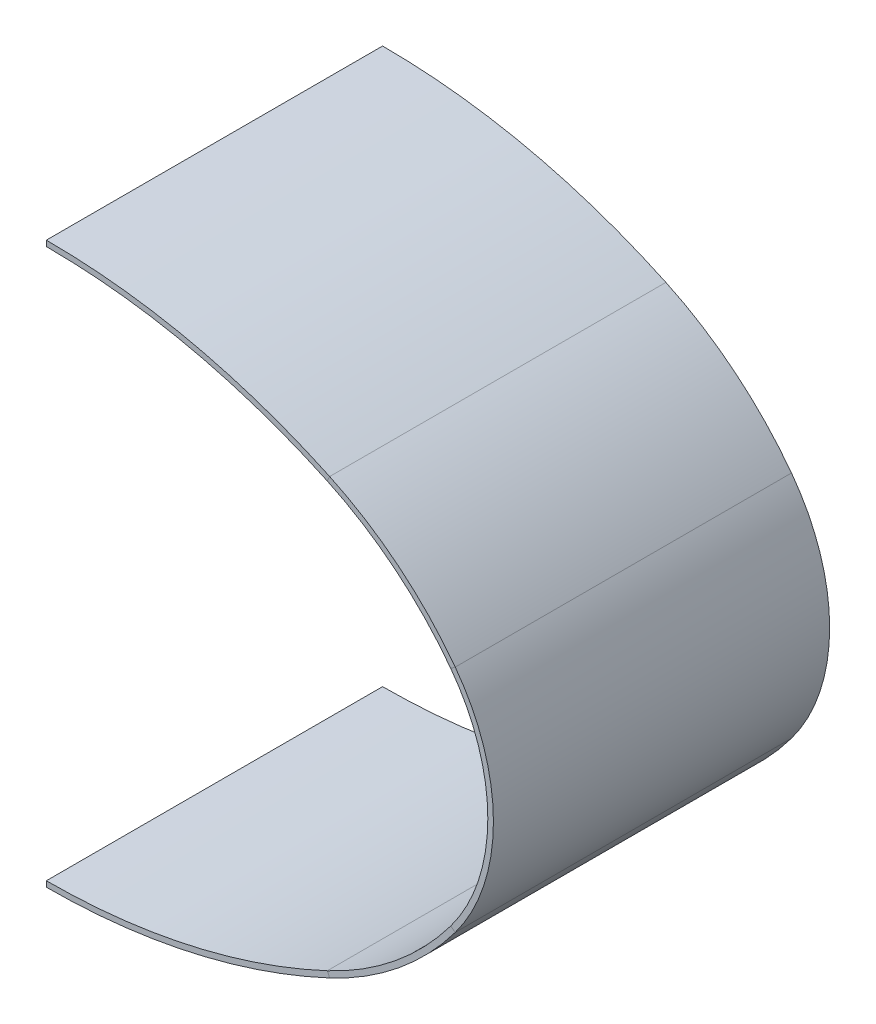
ISO-10303-21;
HEADER;
FILE_DESCRIPTION(('STEP AP214'),'2;1');
FILE_NAME('part.step','',(''),(''),'','','');
FILE_SCHEMA(('AUTOMOTIVE_DESIGN { 1 0 10303 214 1 1 1 1 }'));
ENDSEC;
DATA;
#1=APPLICATION_CONTEXT('core data for automotive mechanical design processes');
#2=APPLICATION_PROTOCOL_DEFINITION('international standard','automotive_design',2000,#1);
#3=PRODUCT_CONTEXT('',#1,'mechanical');
#4=PRODUCT('Part','Part','',(#3));
#5=PRODUCT_RELATED_PRODUCT_CATEGORY('part','',(#4));
#6=PRODUCT_DEFINITION_FORMATION('','',#4);
#7=PRODUCT_DEFINITION_CONTEXT('part definition',#1,'design');
#8=PRODUCT_DEFINITION('design','',#6,#7);
#9=PRODUCT_DEFINITION_SHAPE('','',#8);
#10=(LENGTH_UNIT() NAMED_UNIT(*) SI_UNIT(.MILLI.,.METRE.));
#11=(NAMED_UNIT(*) PLANE_ANGLE_UNIT() SI_UNIT($,.RADIAN.));
#12=(NAMED_UNIT(*) SI_UNIT($,.STERADIAN.) SOLID_ANGLE_UNIT());
#13=UNCERTAINTY_MEASURE_WITH_UNIT(LENGTH_MEASURE(1.E-05),#10,'distance_accuracy_value','');
#14=(GEOMETRIC_REPRESENTATION_CONTEXT(3) GLOBAL_UNCERTAINTY_ASSIGNED_CONTEXT((#13)) GLOBAL_UNIT_ASSIGNED_CONTEXT((#10,
#11,#12)) REPRESENTATION_CONTEXT('',''));
#15=CARTESIAN_POINT('',(0.,0.,0.));
#16=DIRECTION('',(0.,0.,1.));
#17=DIRECTION('',(1.,0.,0.));
#18=AXIS2_PLACEMENT_3D('',#15,#16,#17);
#19=CARTESIAN_POINT('',(-9.54863985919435E-05,-49.3300000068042,30.));
#20=DIRECTION('',(-0.99999998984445,-0.000142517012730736,0.));
#21=DIRECTION('',(0.,0.,-1.));
#22=AXIS2_PLACEMENT_3D('',#19,#20,#21);
#23=PLANE('',#22);
#24=DIRECTION('',(0.,0.,-1.));
#25=VECTOR('',#24,1.);
#26=CARTESIAN_POINT('',(-0.000142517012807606,-49.0000000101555,273.272566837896));
#27=LINE('',#26,#25);
#28=CARTESIAN_POINT('',(-0.000142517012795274,-49.0000000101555,60.));
#29=VERTEX_POINT('',#28);
#30=CARTESIAN_POINT('',(-0.000142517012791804,-49.0000000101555,0.));
#31=VERTEX_POINT('',#30);
#32=EDGE_CURVE('E542',#29,#31,#27,.T.);
#33=ORIENTED_EDGE('',*,*,#32,.T.);
#34=DIRECTION('',(0.000142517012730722,-0.99999998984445,0.));
#35=VECTOR('',#34,1.);
#36=CARTESIAN_POINT('',(-9.54863985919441E-05,-49.3300000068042,0.));
#37=LINE('',#36,#35);
#38=CARTESIAN_POINT('',(0.,-50.,0.));
#39=VERTEX_POINT('',#38);
#40=EDGE_CURVE('E540',#31,#39,#37,.T.);
#41=ORIENTED_EDGE('',*,*,#40,.T.);
#42=DIRECTION('',(0.,0.,-1.));
#43=VECTOR('',#42,1.);
#44=CARTESIAN_POINT('',(0.,-50.,273.272566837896));
#45=LINE('',#44,#43);
#46=CARTESIAN_POINT('',(0.,-50.,60.));
#47=VERTEX_POINT('',#46);
#48=EDGE_CURVE('E527',#47,#39,#45,.T.);
#49=ORIENTED_EDGE('',*,*,#48,.F.);
#50=DIRECTION('',(0.000142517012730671,-0.99999998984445,0.));
#51=VECTOR('',#50,1.);
#52=CARTESIAN_POINT('',(-9.5486398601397E-05,-49.3300000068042,60.));
#53=LINE('',#52,#51);
#54=EDGE_CURVE('E533',#29,#47,#53,.T.);
#55=ORIENTED_EDGE('',*,*,#54,.F.);
#56=EDGE_LOOP('',(#33,#41,#49,#55));
#57=FACE_BOUND('',#56,.T.);
#58=ADVANCED_FACE('F352',(#57),#23,.T.);
#59=CARTESIAN_POINT('',(-0.0170024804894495,69.3014082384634,60.));
#60=DIRECTION('',(0.,0.,1.));
#61=DIRECTION('',(0.,-1.,0.));
#62=AXIS2_PLACEMENT_3D('',#59,#60,#61);
#63=PLANE('',#62);
#64=DIRECTION('',(-0.423917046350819,0.905701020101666,0.));
#65=VECTOR('',#64,1.);
#66=CARTESIAN_POINT('',(50.5568986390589,-38.7499999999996,60.));
#67=LINE('',#66,#65);
#68=CARTESIAN_POINT('',(50.556898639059,-38.7499999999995,60.));
#69=VERTEX_POINT('',#68);
#70=CARTESIAN_POINT('',(50.1329815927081,-37.8442989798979,60.));
#71=VERTEX_POINT('',#70);
#72=EDGE_CURVE('E538',#69,#71,#67,.T.);
#73=ORIENTED_EDGE('',*,*,#72,.T.);
#74=CARTESIAN_POINT('',(-0.0170024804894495,69.3014082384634,60.));
#75=DIRECTION('',(0.,0.,-1.));
#76=DIRECTION('',(-1.,0.,0.));
#77=AXIS2_PLACEMENT_3D('',#74,#75,#76);
#78=CIRCLE('',#77,118.301409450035);
#79=EDGE_CURVE('E535',#71,#29,#78,.T.);
#80=ORIENTED_EDGE('',*,*,#79,.T.);
#81=ORIENTED_EDGE('',*,*,#54,.T.);
#82=CARTESIAN_POINT('',(-0.0170024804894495,69.3014082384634,60.));
#83=DIRECTION('',(0.,0.,-1.));
#84=DIRECTION('',(-1.,0.,0.));
#85=AXIS2_PLACEMENT_3D('',#82,#83,#84);
#86=CIRCLE('',#85,119.301409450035);
#87=EDGE_CURVE('E530',#69,#47,#86,.T.);
#88=ORIENTED_EDGE('',*,*,#87,.F.);
#89=EDGE_LOOP('',(#73,#80,#81,#88));
#90=FACE_BOUND('',#89,.T.);
#91=ADVANCED_FACE('F590',(#90),#63,.T.);
#92=CARTESIAN_POINT('',(-0.0170024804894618,69.3014082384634,273.272566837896));
#93=DIRECTION('',(0.,0.,-1.));
#94=DIRECTION('',(-1.,0.,0.));
#95=AXIS2_PLACEMENT_3D('',#92,#93,#94);
#96=CYLINDRICAL_SURFACE('',#95,119.301409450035);
#97=ORIENTED_EDGE('',*,*,#87,.T.);
#98=ORIENTED_EDGE('',*,*,#48,.T.);
#99=CARTESIAN_POINT('',(-0.017002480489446,69.3014082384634,0.));
#100=DIRECTION('',(0.,0.,-1.));
#101=DIRECTION('',(-1.,0.,0.));
#102=AXIS2_PLACEMENT_3D('',#99,#100,#101);
#103=CIRCLE('',#102,119.301409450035);
#104=CARTESIAN_POINT('',(50.5568986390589,-38.7499999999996,0.));
#105=VERTEX_POINT('',#104);
#106=EDGE_CURVE('E524',#39,#105,#103,.F.);
#107=ORIENTED_EDGE('',*,*,#106,.T.);
#108=DIRECTION('',(0.,0.,1.));
#109=VECTOR('',#108,1.);
#110=CARTESIAN_POINT('',(50.5568986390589,-38.7499999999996,0.));
#111=LINE('',#110,#109);
#112=EDGE_CURVE('E522',#105,#69,#111,.T.);
#113=ORIENTED_EDGE('',*,*,#112,.T.);
#114=EDGE_LOOP('',(#97,#98,#107,#113));
#115=FACE_BOUND('',#114,.T.);
#116=ADVANCED_FACE('F596',(#115),#96,.T.);
#117=CARTESIAN_POINT('',(-0.017002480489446,69.3014082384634,0.));
#118=DIRECTION('',(0.,0.,-1.));
#119=DIRECTION('',(0.,1.,0.));
#120=AXIS2_PLACEMENT_3D('',#117,#118,#119);
#121=PLANE('',#120);
#122=ORIENTED_EDGE('',*,*,#40,.F.);
#123=CARTESIAN_POINT('',(-0.017002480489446,69.3014082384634,0.));
#124=DIRECTION('',(0.,0.,-1.));
#125=DIRECTION('',(-1.,0.,0.));
#126=AXIS2_PLACEMENT_3D('',#123,#124,#125);
#127=CIRCLE('',#126,118.301409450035);
#128=CARTESIAN_POINT('',(50.1329815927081,-37.8442989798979,0.));
#129=VERTEX_POINT('',#128);
#130=EDGE_CURVE('E520',#31,#129,#127,.F.);
#131=ORIENTED_EDGE('',*,*,#130,.T.);
#132=DIRECTION('',(-0.423917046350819,0.905701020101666,0.));
#133=VECTOR('',#132,1.);
#134=CARTESIAN_POINT('',(50.5568986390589,-38.7499999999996,0.));
#135=LINE('',#134,#133);
#136=EDGE_CURVE('E512',#105,#129,#135,.T.);
#137=ORIENTED_EDGE('',*,*,#136,.F.);
#138=ORIENTED_EDGE('',*,*,#106,.F.);
#139=EDGE_LOOP('',(#122,#131,#137,#138));
#140=FACE_BOUND('',#139,.T.);
#141=ADVANCED_FACE('F605',(#140),#121,.T.);
#142=CARTESIAN_POINT('',(-0.0170024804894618,69.3014082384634,273.272566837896));
#143=DIRECTION('',(0.,0.,-1.));
#144=DIRECTION('',(-1.,0.,0.));
#145=AXIS2_PLACEMENT_3D('',#142,#143,#144);
#146=CYLINDRICAL_SURFACE('',#145,118.301409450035);
#147=ORIENTED_EDGE('',*,*,#79,.F.);
#148=DIRECTION('',(0.,0.,1.));
#149=VECTOR('',#148,1.);
#150=CARTESIAN_POINT('',(50.1329815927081,-37.8442989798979,0.));
#151=LINE('',#150,#149);
#152=EDGE_CURVE('E517',#129,#71,#151,.T.);
#153=ORIENTED_EDGE('',*,*,#152,.F.);
#154=ORIENTED_EDGE('',*,*,#130,.F.);
#155=ORIENTED_EDGE('',*,*,#32,.F.);
#156=EDGE_LOOP('',(#147,#153,#154,#155));
#157=FACE_BOUND('',#156,.T.);
#158=ADVANCED_FACE('F609',(#157),#146,.F.);
#159=CARTESIAN_POINT('',(25.3698167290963,15.0623342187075,272.591780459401));
#160=DIRECTION('',(0.,0.,-1.));
#161=DIRECTION('',(-1.,0.,0.));
#162=AXIS2_PLACEMENT_3D('',#159,#160,#161);
#163=CYLINDRICAL_SURFACE('',#162,58.4151193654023);
#164=ORIENTED_EDGE('',*,*,#152,.T.);
#165=CARTESIAN_POINT('',(25.3698167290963,15.0623342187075,60.));
#166=DIRECTION('',(0.,0.,-1.));
#167=DIRECTION('',(-1.,0.,0.));
#168=AXIS2_PLACEMENT_3D('',#165,#166,#167);
#169=CIRCLE('',#168,58.4151193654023);
#170=CARTESIAN_POINT('',(72.1657489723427,-19.9014598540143,60.));
#171=VERTEX_POINT('',#170);
#172=EDGE_CURVE('E499',#171,#71,#169,.T.);
#173=ORIENTED_EDGE('',*,*,#172,.F.);
#174=DIRECTION('',(0.,0.,1.));
#175=VECTOR('',#174,1.);
#176=CARTESIAN_POINT('',(72.1657489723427,-19.9014598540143,0.));
#177=LINE('',#176,#175);
#178=CARTESIAN_POINT('',(72.1657489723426,-19.9014598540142,1.11022302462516E-13));
#179=VERTEX_POINT('',#178);
#180=EDGE_CURVE('E498',#179,#171,#177,.T.);
#181=ORIENTED_EDGE('',*,*,#180,.F.);
#182=CARTESIAN_POINT('',(25.3698167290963,15.0623342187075,0.));
#183=DIRECTION('',(0.,0.,-1.));
#184=DIRECTION('',(-1.,0.,0.));
#185=AXIS2_PLACEMENT_3D('',#182,#183,#184);
#186=CIRCLE('',#185,58.4151193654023);
#187=EDGE_CURVE('E515',#129,#179,#186,.F.);
#188=ORIENTED_EDGE('',*,*,#187,.F.);
#189=EDGE_LOOP('',(#164,#173,#181,#188));
#190=FACE_BOUND('',#189,.T.);
#191=ADVANCED_FACE('F613',(#190),#163,.F.);
#192=CARTESIAN_POINT('',(25.3698167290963,15.0623342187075,0.));
#193=DIRECTION('',(0.,0.,-1.));
#194=DIRECTION('',(-1.,0.,0.));
#195=AXIS2_PLACEMENT_3D('',#192,#193,#194);
#196=PLANE('',#195);
#197=ORIENTED_EDGE('',*,*,#187,.T.);
#198=DIRECTION('',(-0.801092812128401,0.598540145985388,0.));
#199=VECTOR('',#198,1.);
#200=CARTESIAN_POINT('',(72.966841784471,-20.4999999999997,0.));
#201=LINE('',#200,#199);
#202=CARTESIAN_POINT('',(72.966841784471,-20.4999999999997,0.));
#203=VERTEX_POINT('',#202);
#204=EDGE_CURVE('E545',#203,#179,#201,.T.);
#205=ORIENTED_EDGE('',*,*,#204,.F.);
#206=CARTESIAN_POINT('',(25.3698167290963,15.0623342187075,0.));
#207=DIRECTION('',(0.,0.,-1.));
#208=DIRECTION('',(-1.,0.,0.));
#209=AXIS2_PLACEMENT_3D('',#206,#207,#208);
#210=CIRCLE('',#209,59.4151193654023);
#211=EDGE_CURVE('E509',#105,#203,#210,.F.);
#212=ORIENTED_EDGE('',*,*,#211,.F.);
#213=ORIENTED_EDGE('',*,*,#136,.T.);
#214=EDGE_LOOP('',(#197,#205,#212,#213));
#215=FACE_BOUND('',#214,.T.);
#216=ADVANCED_FACE('F617',(#215),#196,.T.);
#217=CARTESIAN_POINT('',(25.3698167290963,15.0623342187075,272.591780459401));
#218=DIRECTION('',(0.,0.,-1.));
#219=DIRECTION('',(-1.,0.,0.));
#220=AXIS2_PLACEMENT_3D('',#217,#218,#219);
#221=CYLINDRICAL_SURFACE('',#220,59.4151193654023);
#222=ORIENTED_EDGE('',*,*,#112,.F.);
#223=ORIENTED_EDGE('',*,*,#211,.T.);
#224=DIRECTION('',(0.,0.,1.));
#225=VECTOR('',#224,1.);
#226=CARTESIAN_POINT('',(72.966841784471,-20.4999999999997,0.));
#227=LINE('',#226,#225);
#228=CARTESIAN_POINT('',(72.9668417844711,-20.4999999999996,60.));
#229=VERTEX_POINT('',#228);
#230=EDGE_CURVE('E507',#203,#229,#227,.T.);
#231=ORIENTED_EDGE('',*,*,#230,.T.);
#232=CARTESIAN_POINT('',(25.3698167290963,15.0623342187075,60.));
#233=DIRECTION('',(0.,0.,-1.));
#234=DIRECTION('',(-1.,0.,0.));
#235=AXIS2_PLACEMENT_3D('',#232,#233,#234);
#236=CIRCLE('',#235,59.4151193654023);
#237=EDGE_CURVE('E504',#229,#69,#236,.T.);
#238=ORIENTED_EDGE('',*,*,#237,.T.);
#239=EDGE_LOOP('',(#222,#223,#231,#238));
#240=FACE_BOUND('',#239,.T.);
#241=ADVANCED_FACE('F620',(#240),#221,.T.);
#242=CARTESIAN_POINT('',(25.3698167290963,15.0623342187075,60.));
#243=DIRECTION('',(0.,0.,1.));
#244=DIRECTION('',(1.,0.,0.));
#245=AXIS2_PLACEMENT_3D('',#242,#243,#244);
#246=PLANE('',#245);
#247=DIRECTION('',(-0.801092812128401,0.598540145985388,0.));
#248=VECTOR('',#247,1.);
#249=CARTESIAN_POINT('',(72.966841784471,-20.4999999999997,60.));
#250=LINE('',#249,#248);
#251=EDGE_CURVE('E502',#229,#171,#250,.T.);
#252=ORIENTED_EDGE('',*,*,#251,.T.);
#253=ORIENTED_EDGE('',*,*,#172,.T.);
#254=ORIENTED_EDGE('',*,*,#72,.F.);
#255=ORIENTED_EDGE('',*,*,#237,.F.);
#256=EDGE_LOOP('',(#252,#253,#254,#255));
#257=FACE_BOUND('',#256,.T.);
#258=ADVANCED_FACE('F354',(#257),#246,.T.);
#259=CARTESIAN_POINT('',(45.5294129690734,0.,60.));
#260=DIRECTION('',(0.,0.,1.));
#261=DIRECTION('',(1.,0.,0.));
#262=AXIS2_PLACEMENT_3D('',#259,#260,#261);
#263=PLANE('',#262);
#264=DIRECTION('',(-0.801092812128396,-0.598540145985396,0.));
#265=VECTOR('',#264,1.);
#266=CARTESIAN_POINT('',(72.966841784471,20.4999999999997,60.));
#267=LINE('',#266,#265);
#268=CARTESIAN_POINT('',(72.966841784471,20.4999999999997,60.0000000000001));
#269=VERTEX_POINT('',#268);
#270=CARTESIAN_POINT('',(72.1657489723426,19.9014598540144,60.));
#271=VERTEX_POINT('',#270);
#272=EDGE_CURVE('E377',#269,#271,#267,.T.);
#273=ORIENTED_EDGE('',*,*,#272,.T.);
#274=CARTESIAN_POINT('',(45.5294129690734,0.,60.0000000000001));
#275=DIRECTION('',(0.,0.,-1.));
#276=DIRECTION('',(-1.,0.,0.));
#277=AXIS2_PLACEMENT_3D('',#274,#275,#276);
#278=CIRCLE('',#277,33.25);
#279=EDGE_CURVE('E489',#271,#171,#278,.T.);
#280=ORIENTED_EDGE('',*,*,#279,.T.);
#281=ORIENTED_EDGE('',*,*,#251,.F.);
#282=CARTESIAN_POINT('',(45.5294129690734,0.,60.0000000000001));
#283=DIRECTION('',(0.,0.,-1.));
#284=DIRECTION('',(-1.,0.,0.));
#285=AXIS2_PLACEMENT_3D('',#282,#283,#284);
#286=CIRCLE('',#285,34.25);
#287=EDGE_CURVE('E493',#269,#229,#286,.T.);
#288=ORIENTED_EDGE('',*,*,#287,.F.);
#289=EDGE_LOOP('',(#273,#280,#281,#288));
#290=FACE_BOUND('',#289,.T.);
#291=ADVANCED_FACE('F627',(#290),#263,.T.);
#292=CARTESIAN_POINT('',(45.5294129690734,0.,0.));
#293=DIRECTION('',(0.,0.,-1.));
#294=DIRECTION('',(0.,1.,0.));
#295=AXIS2_PLACEMENT_3D('',#292,#293,#294);
#296=PLANE('',#295);
#297=CARTESIAN_POINT('',(45.5294129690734,0.,1.11022302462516E-13));
#298=DIRECTION('',(0.,0.,-1.));
#299=DIRECTION('',(-1.,0.,0.));
#300=AXIS2_PLACEMENT_3D('',#297,#298,#299);
#301=CIRCLE('',#300,33.25);
#302=CARTESIAN_POINT('',(72.1657489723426,19.9014598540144,0.));
#303=VERTEX_POINT('',#302);
#304=EDGE_CURVE('E491',#179,#303,#301,.F.);
#305=ORIENTED_EDGE('',*,*,#304,.T.);
#306=DIRECTION('',(-0.801092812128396,-0.598540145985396,0.));
#307=VECTOR('',#306,1.);
#308=CARTESIAN_POINT('',(72.966841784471,20.4999999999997,0.));
#309=LINE('',#308,#307);
#310=CARTESIAN_POINT('',(72.966841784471,20.4999999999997,0.));
#311=VERTEX_POINT('',#310);
#312=EDGE_CURVE('E369',#311,#303,#309,.T.);
#313=ORIENTED_EDGE('',*,*,#312,.F.);
#314=CARTESIAN_POINT('',(45.5294129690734,0.,1.11022302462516E-13));
#315=DIRECTION('',(0.,0.,-1.));
#316=DIRECTION('',(-1.,0.,0.));
#317=AXIS2_PLACEMENT_3D('',#314,#315,#316);
#318=CIRCLE('',#317,34.25);
#319=EDGE_CURVE('E496',#203,#311,#318,.F.);
#320=ORIENTED_EDGE('',*,*,#319,.F.);
#321=ORIENTED_EDGE('',*,*,#204,.T.);
#322=EDGE_LOOP('',(#305,#313,#320,#321));
#323=FACE_BOUND('',#322,.T.);
#324=ADVANCED_FACE('F600',(#323),#296,.T.);
#325=CARTESIAN_POINT('',(45.5294129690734,0.,264.86373576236));
#326=DIRECTION('',(0.,0.,-1.));
#327=DIRECTION('',(-1.,0.,0.));
#328=AXIS2_PLACEMENT_3D('',#325,#326,#327);
#329=CYLINDRICAL_SURFACE('',#328,34.25);
#330=ORIENTED_EDGE('',*,*,#230,.F.);
#331=ORIENTED_EDGE('',*,*,#319,.T.);
#332=DIRECTION('',(0.,0.,1.));
#333=VECTOR('',#332,1.);
#334=CARTESIAN_POINT('',(72.966841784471,20.4999999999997,0.));
#335=LINE('',#334,#333);
#336=EDGE_CURVE('E551',#311,#269,#335,.T.);
#337=ORIENTED_EDGE('',*,*,#336,.T.);
#338=ORIENTED_EDGE('',*,*,#287,.T.);
#339=EDGE_LOOP('',(#330,#331,#337,#338));
#340=FACE_BOUND('',#339,.T.);
#341=ADVANCED_FACE('F649',(#340),#329,.T.);
#342=CARTESIAN_POINT('',(45.5294129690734,0.,264.86373576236));
#343=DIRECTION('',(0.,0.,-1.));
#344=DIRECTION('',(-1.,0.,0.));
#345=AXIS2_PLACEMENT_3D('',#342,#343,#344);
#346=CYLINDRICAL_SURFACE('',#345,33.25);
#347=ORIENTED_EDGE('',*,*,#180,.T.);
#348=ORIENTED_EDGE('',*,*,#279,.F.);
#349=DIRECTION('',(0.,0.,1.));
#350=VECTOR('',#349,1.);
#351=CARTESIAN_POINT('',(72.1657489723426,19.9014598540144,0.));
#352=LINE('',#351,#350);
#353=EDGE_CURVE('E477',#303,#271,#352,.T.);
#354=ORIENTED_EDGE('',*,*,#353,.F.);
#355=ORIENTED_EDGE('',*,*,#304,.F.);
#356=EDGE_LOOP('',(#347,#348,#354,#355));
#357=FACE_BOUND('',#356,.T.);
#358=ADVANCED_FACE('F647',(#357),#346,.F.);
#359=CARTESIAN_POINT('',(25.3698167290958,-15.062334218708,60.));
#360=DIRECTION('',(0.,0.,1.));
#361=DIRECTION('',(1.,0.,0.));
#362=AXIS2_PLACEMENT_3D('',#359,#360,#361);
#363=PLANE('',#362);
#364=DIRECTION('',(-0.423917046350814,-0.905701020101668,0.));
#365=VECTOR('',#364,1.);
#366=CARTESIAN_POINT('',(50.5568986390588,38.7499999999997,60.));
#367=LINE('',#366,#365);
#368=CARTESIAN_POINT('',(50.5568986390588,38.7499999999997,60.));
#369=VERTEX_POINT('',#368);
#370=CARTESIAN_POINT('',(50.132981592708,37.8442989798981,60.));
#371=VERTEX_POINT('',#370);
#372=EDGE_CURVE('E356',#369,#371,#367,.T.);
#373=ORIENTED_EDGE('',*,*,#372,.T.);
#374=CARTESIAN_POINT('',(25.3698167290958,-15.062334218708,60.));
#375=DIRECTION('',(0.,0.,-1.));
#376=DIRECTION('',(-1.,0.,0.));
#377=AXIS2_PLACEMENT_3D('',#374,#375,#376);
#378=CIRCLE('',#377,58.415119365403);
#379=EDGE_CURVE('E470',#371,#271,#378,.T.);
#380=ORIENTED_EDGE('',*,*,#379,.T.);
#381=ORIENTED_EDGE('',*,*,#272,.F.);
#382=CARTESIAN_POINT('',(25.3698167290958,-15.062334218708,60.));
#383=DIRECTION('',(0.,0.,-1.));
#384=DIRECTION('',(-1.,0.,0.));
#385=AXIS2_PLACEMENT_3D('',#382,#383,#384);
#386=CIRCLE('',#385,59.415119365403);
#387=EDGE_CURVE('E473',#369,#269,#386,.T.);
#388=ORIENTED_EDGE('',*,*,#387,.F.);
#389=EDGE_LOOP('',(#373,#380,#381,#388));
#390=FACE_BOUND('',#389,.T.);
#391=ADVANCED_FACE('F469',(#390),#363,.T.);
#392=CARTESIAN_POINT('',(25.3698167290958,-15.062334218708,0.));
#393=DIRECTION('',(0.,0.,-1.));
#394=DIRECTION('',(0.,1.,0.));
#395=AXIS2_PLACEMENT_3D('',#392,#393,#394);
#396=PLANE('',#395);
#397=CARTESIAN_POINT('',(25.3698167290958,-15.062334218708,0.));
#398=DIRECTION('',(0.,0.,-1.));
#399=DIRECTION('',(-1.,0.,0.));
#400=AXIS2_PLACEMENT_3D('',#397,#398,#399);
#401=CIRCLE('',#400,58.415119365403);
#402=CARTESIAN_POINT('',(50.132981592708,37.8442989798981,0.));
#403=VERTEX_POINT('',#402);
#404=EDGE_CURVE('E478',#303,#403,#401,.F.);
#405=ORIENTED_EDGE('',*,*,#404,.T.);
#406=DIRECTION('',(-0.423917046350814,-0.905701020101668,0.));
#407=VECTOR('',#406,1.);
#408=CARTESIAN_POINT('',(50.5568986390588,38.7499999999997,0.));
#409=LINE('',#408,#407);
#410=CARTESIAN_POINT('',(50.5568986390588,38.7499999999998,0.));
#411=VERTEX_POINT('',#410);
#412=EDGE_CURVE('E361',#411,#403,#409,.T.);
#413=ORIENTED_EDGE('',*,*,#412,.F.);
#414=CARTESIAN_POINT('',(25.3698167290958,-15.062334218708,0.));
#415=DIRECTION('',(0.,0.,-1.));
#416=DIRECTION('',(-1.,0.,0.));
#417=AXIS2_PLACEMENT_3D('',#414,#415,#416);
#418=CIRCLE('',#417,59.415119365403);
#419=EDGE_CURVE('E486',#311,#411,#418,.F.);
#420=ORIENTED_EDGE('',*,*,#419,.F.);
#421=ORIENTED_EDGE('',*,*,#312,.T.);
#422=EDGE_LOOP('',(#405,#413,#420,#421));
#423=FACE_BOUND('',#422,.T.);
#424=ADVANCED_FACE('F569',(#423),#396,.T.);
#425=CARTESIAN_POINT('',(25.3698167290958,-15.062334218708,228.069143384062));
#426=DIRECTION('',(0.,0.,-1.));
#427=DIRECTION('',(-1.,0.,0.));
#428=AXIS2_PLACEMENT_3D('',#425,#426,#427);
#429=CYLINDRICAL_SURFACE('',#428,59.415119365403);
#430=ORIENTED_EDGE('',*,*,#336,.F.);
#431=ORIENTED_EDGE('',*,*,#419,.T.);
#432=DIRECTION('',(0.,0.,1.));
#433=VECTOR('',#432,1.);
#434=CARTESIAN_POINT('',(50.5568986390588,38.7499999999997,0.));
#435=LINE('',#434,#433);
#436=EDGE_CURVE('E474',#411,#369,#435,.T.);
#437=ORIENTED_EDGE('',*,*,#436,.T.);
#438=ORIENTED_EDGE('',*,*,#387,.T.);
#439=EDGE_LOOP('',(#430,#431,#437,#438));
#440=FACE_BOUND('',#439,.T.);
#441=ADVANCED_FACE('F558',(#440),#429,.T.);
#442=CARTESIAN_POINT('',(25.3698167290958,-15.062334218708,228.069143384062));
#443=DIRECTION('',(0.,0.,-1.));
#444=DIRECTION('',(-1.,0.,0.));
#445=AXIS2_PLACEMENT_3D('',#442,#443,#444);
#446=CYLINDRICAL_SURFACE('',#445,58.415119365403);
#447=ORIENTED_EDGE('',*,*,#353,.T.);
#448=ORIENTED_EDGE('',*,*,#379,.F.);
#449=DIRECTION('',(0.,0.,1.));
#450=VECTOR('',#449,1.);
#451=CARTESIAN_POINT('',(50.132981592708,37.8442989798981,0.));
#452=LINE('',#451,#450);
#453=EDGE_CURVE('E11',#403,#371,#452,.T.);
#454=ORIENTED_EDGE('',*,*,#453,.F.);
#455=ORIENTED_EDGE('',*,*,#404,.F.);
#456=EDGE_LOOP('',(#447,#448,#454,#455));
#457=FACE_BOUND('',#456,.T.);
#458=ADVANCED_FACE('F475',(#457),#446,.F.);
#459=CARTESIAN_POINT('',(-9.548639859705E-05,49.3300000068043,30.));
#460=DIRECTION('',(-0.999999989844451,0.000142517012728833,0.));
#461=DIRECTION('',(0.,0.,1.));
#462=AXIS2_PLACEMENT_3D('',#459,#460,#461);
#463=PLANE('',#462);
#464=DIRECTION('',(0.000142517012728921,0.999999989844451,0.));
#465=VECTOR('',#464,1.);
#466=CARTESIAN_POINT('',(-9.54863985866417E-05,49.3300000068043,0.));
#467=LINE('',#466,#465);
#468=CARTESIAN_POINT('',(-0.000142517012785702,49.0000000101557,0.));
#469=VERTEX_POINT('',#468);
#470=CARTESIAN_POINT('',(0.,50.0000000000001,0.));
#471=VERTEX_POINT('',#470);
#472=EDGE_CURVE('E479',#469,#471,#467,.T.);
#473=ORIENTED_EDGE('',*,*,#472,.F.);
#474=DIRECTION('',(0.,0.,-1.));
#475=VECTOR('',#474,1.);
#476=CARTESIAN_POINT('',(-0.000142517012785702,49.0000000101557,209.104383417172));
#477=LINE('',#476,#475);
#478=CARTESIAN_POINT('',(-0.00014251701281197,49.0000000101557,60.));
#479=VERTEX_POINT('',#478);
#480=EDGE_CURVE('E455',#469,#479,#477,.F.);
#481=ORIENTED_EDGE('',*,*,#480,.T.);
#482=DIRECTION('',(0.000142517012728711,0.999999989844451,0.));
#483=VECTOR('',#482,1.);
#484=CARTESIAN_POINT('',(-9.5486398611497E-05,49.3300000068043,60.));
#485=LINE('',#484,#483);
#486=CARTESIAN_POINT('',(0.,50.0000000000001,60.));
#487=VERTEX_POINT('',#486);
#488=EDGE_CURVE('E451',#479,#487,#485,.T.);
#489=ORIENTED_EDGE('',*,*,#488,.T.);
#490=DIRECTION('',(0.,0.,-1.));
#491=VECTOR('',#490,1.);
#492=CARTESIAN_POINT('',(0.,50.0000000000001,209.104383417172));
#493=LINE('',#492,#491);
#494=EDGE_CURVE('E572',#471,#487,#493,.F.);
#495=ORIENTED_EDGE('',*,*,#494,.F.);
#496=EDGE_LOOP('',(#473,#481,#489,#495));
#497=FACE_BOUND('',#496,.T.);
#498=ADVANCED_FACE('F579',(#497),#463,.T.);
#499=CARTESIAN_POINT('',(-0.0170024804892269,-69.301408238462,60.));
#500=DIRECTION('',(0.,0.,1.));
#501=DIRECTION('',(1.,0.,0.));
#502=AXIS2_PLACEMENT_3D('',#499,#500,#501);
#503=PLANE('',#502);
#504=ORIENTED_EDGE('',*,*,#488,.F.);
#505=CARTESIAN_POINT('',(-0.0170024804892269,-69.301408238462,60.));
#506=DIRECTION('',(0.,0.,-1.));
#507=DIRECTION('',(-1.,0.,0.));
#508=AXIS2_PLACEMENT_3D('',#505,#506,#507);
#509=CIRCLE('',#508,118.301409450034);
#510=EDGE_CURVE('E446',#479,#371,#509,.T.);
#511=ORIENTED_EDGE('',*,*,#510,.T.);
#512=ORIENTED_EDGE('',*,*,#372,.F.);
#513=CARTESIAN_POINT('',(-0.0170024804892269,-69.301408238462,60.));
#514=DIRECTION('',(0.,0.,-1.));
#515=DIRECTION('',(-1.,0.,0.));
#516=AXIS2_PLACEMENT_3D('',#513,#514,#515);
#517=CIRCLE('',#516,119.301409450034);
#518=EDGE_CURVE('E567',#487,#369,#517,.T.);
#519=ORIENTED_EDGE('',*,*,#518,.F.);
#520=EDGE_LOOP('',(#504,#511,#512,#519));
#521=FACE_BOUND('',#520,.T.);
#522=ADVANCED_FACE('F447',(#521),#503,.T.);
#523=CARTESIAN_POINT('',(-0.0170024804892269,-69.301408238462,0.));
#524=DIRECTION('',(0.,0.,-1.));
#525=DIRECTION('',(-1.,0.,0.));
#526=AXIS2_PLACEMENT_3D('',#523,#524,#525);
#527=PLANE('',#526);
#528=CARTESIAN_POINT('',(-0.0170024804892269,-69.301408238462,0.));
#529=DIRECTION('',(0.,0.,-1.));
#530=DIRECTION('',(-1.,0.,0.));
#531=AXIS2_PLACEMENT_3D('',#528,#529,#530);
#532=CIRCLE('',#531,118.301409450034);
#533=EDGE_CURVE('E461',#403,#469,#532,.F.);
#534=ORIENTED_EDGE('',*,*,#533,.T.);
#535=ORIENTED_EDGE('',*,*,#472,.T.);
#536=CARTESIAN_POINT('',(-0.0170024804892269,-69.301408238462,0.));
#537=DIRECTION('',(0.,0.,-1.));
#538=DIRECTION('',(-1.,0.,0.));
#539=AXIS2_PLACEMENT_3D('',#536,#537,#538);
#540=CIRCLE('',#539,119.301409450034);
#541=EDGE_CURVE('E565',#411,#471,#540,.F.);
#542=ORIENTED_EDGE('',*,*,#541,.F.);
#543=ORIENTED_EDGE('',*,*,#412,.T.);
#544=EDGE_LOOP('',(#534,#535,#542,#543));
#545=FACE_BOUND('',#544,.T.);
#546=ADVANCED_FACE('F571',(#545),#527,.T.);
#547=CARTESIAN_POINT('',(-0.0170024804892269,-69.301408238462,209.104383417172));
#548=DIRECTION('',(0.,0.,-1.));
#549=DIRECTION('',(-1.,0.,0.));
#550=AXIS2_PLACEMENT_3D('',#547,#548,#549);
#551=CYLINDRICAL_SURFACE('',#550,119.301409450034);
#552=ORIENTED_EDGE('',*,*,#436,.F.);
#553=ORIENTED_EDGE('',*,*,#541,.T.);
#554=ORIENTED_EDGE('',*,*,#494,.T.);
#555=ORIENTED_EDGE('',*,*,#518,.T.);
#556=EDGE_LOOP('',(#552,#553,#554,#555));
#557=FACE_BOUND('',#556,.T.);
#558=ADVANCED_FACE('F563',(#557),#551,.T.);
#559=CARTESIAN_POINT('',(-0.0170024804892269,-69.301408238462,209.104383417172));
#560=DIRECTION('',(0.,0.,-1.));
#561=DIRECTION('',(-1.,0.,0.));
#562=AXIS2_PLACEMENT_3D('',#559,#560,#561);
#563=CYLINDRICAL_SURFACE('',#562,118.301409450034);
#564=ORIENTED_EDGE('',*,*,#453,.T.);
#565=ORIENTED_EDGE('',*,*,#510,.F.);
#566=ORIENTED_EDGE('',*,*,#480,.F.);
#567=ORIENTED_EDGE('',*,*,#533,.F.);
#568=EDGE_LOOP('',(#564,#565,#566,#567));
#569=FACE_BOUND('',#568,.T.);
#570=ADVANCED_FACE('F459',(#569),#563,.F.);
#571=CLOSED_SHELL('',(#58,#91,#116,#141,#158,#191,#216,#241,#258,#291,#324,#341,#358,#391,#424,
#441,#458,#498,#522,#546,#558,#570));
#572=MANIFOLD_SOLID_BREP('B2',#571);
#573=ADVANCED_BREP_SHAPE_REPRESENTATION('',(#18,#572),#14);
#574=SHAPE_DEFINITION_REPRESENTATION(#9,#573);
ENDSEC;
END-ISO-10303-21;
